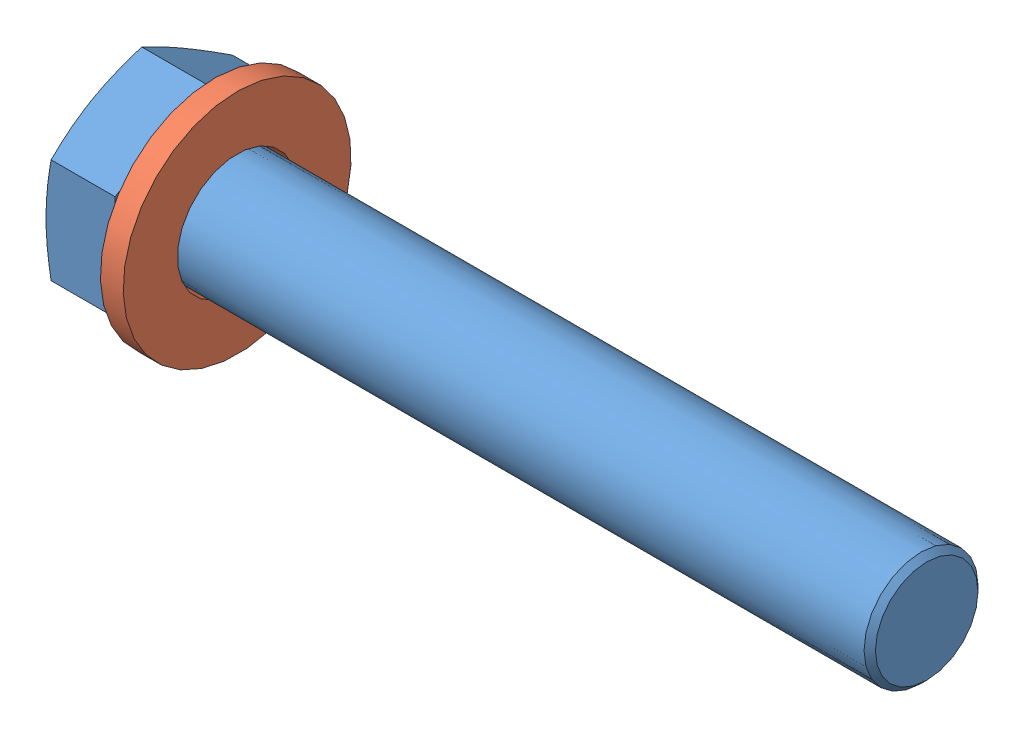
SolidWorks assembly Assemblage1.sldasm, configuration Défaut (file format 3400). Lengths in mm.
Overall size (55.45 20.9 20.9).
2 component instances, 2 part files, 2 mates.
Components (placement in the parent):
- Vis M8 50 mm-1: Vis M8 50 mm.SLDPRT [GB_FASTENER_BOLT_STBAB A M8X50-N] at origin size (55.45 14.7 12.73)
- Rondelle M8-1: Rondelle M8.SLDPRT [Washer ISO 7089 - 8] at (5.45 0 0) x (-1 0 0) z (0 0.924225 0.381849) size (1.6 16 16)
Mates (geometry in assembly coordinates):
- Coaxiale11: concentric: cylinder of ?; cylinder of ?
- Coïncidente11: coincident anti-aligned: plane of ?; plane of ?
